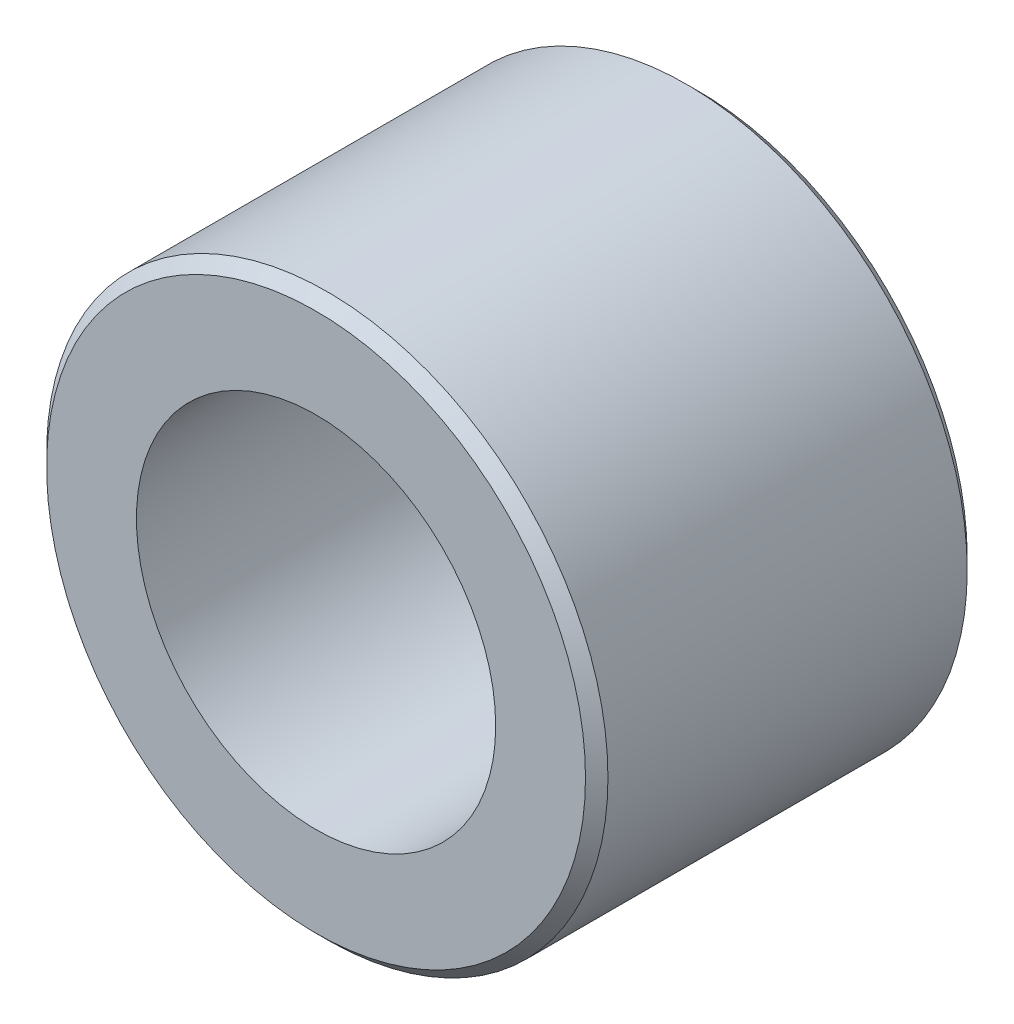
ISO-10303-21;
HEADER;
FILE_DESCRIPTION(('STEP AP214'),'2;1');
FILE_NAME('part.step','',(''),(''),'','','');
FILE_SCHEMA(('AUTOMOTIVE_DESIGN { 1 0 10303 214 1 1 1 1 }'));
ENDSEC;
DATA;
#1=APPLICATION_CONTEXT('core data for automotive mechanical design processes');
#2=APPLICATION_PROTOCOL_DEFINITION('international standard','automotive_design',2000,#1);
#3=PRODUCT_CONTEXT('',#1,'mechanical');
#4=PRODUCT('Part','Part','',(#3));
#5=PRODUCT_RELATED_PRODUCT_CATEGORY('part','',(#4));
#6=PRODUCT_DEFINITION_FORMATION('','',#4);
#7=PRODUCT_DEFINITION_CONTEXT('part definition',#1,'design');
#8=PRODUCT_DEFINITION('design','',#6,#7);
#9=PRODUCT_DEFINITION_SHAPE('','',#8);
#10=(LENGTH_UNIT() NAMED_UNIT(*) SI_UNIT(.MILLI.,.METRE.));
#11=(NAMED_UNIT(*) PLANE_ANGLE_UNIT() SI_UNIT($,.RADIAN.));
#12=(NAMED_UNIT(*) SI_UNIT($,.STERADIAN.) SOLID_ANGLE_UNIT());
#13=UNCERTAINTY_MEASURE_WITH_UNIT(LENGTH_MEASURE(1.E-05),#10,'distance_accuracy_value','');
#14=(GEOMETRIC_REPRESENTATION_CONTEXT(3) GLOBAL_UNCERTAINTY_ASSIGNED_CONTEXT((#13)) GLOBAL_UNIT_ASSIGNED_CONTEXT((#10,
#11,#12)) REPRESENTATION_CONTEXT('',''));
#15=CARTESIAN_POINT('',(0.,0.,0.));
#16=DIRECTION('',(0.,0.,1.));
#17=DIRECTION('',(1.,0.,0.));
#18=AXIS2_PLACEMENT_3D('',#15,#16,#17);
#19=CARTESIAN_POINT('',(0.,0.,17.));
#20=DIRECTION('',(0.,0.,1.));
#21=DIRECTION('',(1.,0.,0.));
#22=AXIS2_PLACEMENT_3D('',#19,#20,#21);
#23=PLANE('',#22);
#24=CARTESIAN_POINT('',(0.,0.,17.));
#25=DIRECTION('',(0.,0.,1.));
#26=DIRECTION('',(1.,0.,0.));
#27=AXIS2_PLACEMENT_3D('',#24,#25,#26);
#28=CIRCLE('',#27,12.);
#29=CARTESIAN_POINT('',(12.,0.,17.));
#30=VERTEX_POINT('',#29);
#31=EDGE_CURVE('E363',#30,#30,#28,.T.);
#32=ORIENTED_EDGE('',*,*,#31,.T.);
#33=EDGE_LOOP('',(#32));
#34=FACE_BOUND('',#33,.T.);
#35=CARTESIAN_POINT('',(0.,0.,17.));
#36=DIRECTION('',(0.,0.,1.));
#37=DIRECTION('',(1.,0.,0.));
#38=AXIS2_PLACEMENT_3D('',#35,#36,#37);
#39=CIRCLE('',#38,8.);
#40=CARTESIAN_POINT('',(8.,0.,17.));
#41=VERTEX_POINT('',#40);
#42=EDGE_CURVE('E368',#41,#41,#39,.T.);
#43=ORIENTED_EDGE('',*,*,#42,.F.);
#44=EDGE_LOOP('',(#43));
#45=FACE_BOUND('',#44,.T.);
#46=ADVANCED_FACE('F348',(#34,#45),#23,.T.);
#47=CARTESIAN_POINT('',(0.,0.,0.));
#48=DIRECTION('',(0.,0.,1.));
#49=DIRECTION('',(1.,0.,0.));
#50=AXIS2_PLACEMENT_3D('',#47,#48,#49);
#51=PLANE('',#50);
#52=CARTESIAN_POINT('',(0.,0.,0.));
#53=DIRECTION('',(0.,0.,1.));
#54=DIRECTION('',(1.,0.,0.));
#55=AXIS2_PLACEMENT_3D('',#52,#53,#54);
#56=CIRCLE('',#55,12.);
#57=CARTESIAN_POINT('',(12.,0.,0.));
#58=VERTEX_POINT('',#57);
#59=EDGE_CURVE('E10',#58,#58,#56,.F.);
#60=ORIENTED_EDGE('',*,*,#59,.T.);
#61=EDGE_LOOP('',(#60));
#62=FACE_BOUND('',#61,.T.);
#63=CARTESIAN_POINT('',(0.,0.,0.));
#64=DIRECTION('',(0.,0.,1.));
#65=DIRECTION('',(1.,0.,0.));
#66=AXIS2_PLACEMENT_3D('',#63,#64,#65);
#67=CIRCLE('',#66,8.);
#68=CARTESIAN_POINT('',(8.,0.,0.));
#69=VERTEX_POINT('',#68);
#70=EDGE_CURVE('E371',#69,#69,#67,.T.);
#71=ORIENTED_EDGE('',*,*,#70,.T.);
#72=EDGE_LOOP('',(#71));
#73=FACE_BOUND('',#72,.T.);
#74=ADVANCED_FACE('F375',(#62,#73),#51,.F.);
#75=CARTESIAN_POINT('',(0.,0.,17.));
#76=DIRECTION('',(0.,0.,-1.));
#77=DIRECTION('',(-1.,0.,0.));
#78=AXIS2_PLACEMENT_3D('',#75,#76,#77);
#79=CYLINDRICAL_SURFACE('',#78,12.5);
#80=CARTESIAN_POINT('',(0.,0.,16.5));
#81=DIRECTION('',(0.,0.,1.));
#82=DIRECTION('',(1.,0.,0.));
#83=AXIS2_PLACEMENT_3D('',#80,#81,#82);
#84=CIRCLE('',#83,12.5);
#85=CARTESIAN_POINT('',(12.5,0.,16.5));
#86=VERTEX_POINT('',#85);
#87=EDGE_CURVE('E355',#86,#86,#84,.F.);
#88=ORIENTED_EDGE('',*,*,#87,.T.);
#89=EDGE_LOOP('',(#88));
#90=FACE_BOUND('',#89,.T.);
#91=CARTESIAN_POINT('',(0.,0.,0.5));
#92=DIRECTION('',(0.,0.,1.));
#93=DIRECTION('',(1.,0.,0.));
#94=AXIS2_PLACEMENT_3D('',#91,#92,#93);
#95=CIRCLE('',#94,12.5);
#96=CARTESIAN_POINT('',(12.5,0.,0.5));
#97=VERTEX_POINT('',#96);
#98=EDGE_CURVE('E359',#97,#97,#95,.T.);
#99=ORIENTED_EDGE('',*,*,#98,.T.);
#100=EDGE_LOOP('',(#99));
#101=FACE_BOUND('',#100,.T.);
#102=ADVANCED_FACE('F350',(#90,#101),#79,.T.);
#103=CARTESIAN_POINT('',(0.,0.,17.));
#104=DIRECTION('',(0.,0.,-1.));
#105=DIRECTION('',(-1.,0.,0.));
#106=AXIS2_PLACEMENT_3D('',#103,#104,#105);
#107=CYLINDRICAL_SURFACE('',#106,8.);
#108=ORIENTED_EDGE('',*,*,#42,.T.);
#109=EDGE_LOOP('',(#108));
#110=FACE_BOUND('',#109,.T.);
#111=ORIENTED_EDGE('',*,*,#70,.F.);
#112=EDGE_LOOP('',(#111));
#113=FACE_BOUND('',#112,.T.);
#114=ADVANCED_FACE('F377',(#110,#113),#107,.F.);
#115=CARTESIAN_POINT('',(0.,0.,17.));
#116=DIRECTION('',(0.,0.,-1.));
#117=DIRECTION('',(-1.,0.,0.));
#118=AXIS2_PLACEMENT_3D('',#115,#116,#117);
#119=CONICAL_SURFACE('',#118,12.,0.785398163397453);
#120=ORIENTED_EDGE('',*,*,#87,.F.);
#121=EDGE_LOOP('',(#120));
#122=FACE_BOUND('',#121,.T.);
#123=ORIENTED_EDGE('',*,*,#31,.F.);
#124=EDGE_LOOP('',(#123));
#125=FACE_BOUND('',#124,.T.);
#126=ADVANCED_FACE('F379',(#122,#125),#119,.T.);
#127=CARTESIAN_POINT('',(0.,0.,0.5));
#128=DIRECTION('',(0.,0.,1.));
#129=DIRECTION('',(1.,0.,0.));
#130=AXIS2_PLACEMENT_3D('',#127,#128,#129);
#131=CONICAL_SURFACE('',#130,12.5,0.785398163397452);
#132=ORIENTED_EDGE('',*,*,#59,.F.);
#133=EDGE_LOOP('',(#132));
#134=FACE_BOUND('',#133,.T.);
#135=ORIENTED_EDGE('',*,*,#98,.F.);
#136=EDGE_LOOP('',(#135));
#137=FACE_BOUND('',#136,.T.);
#138=ADVANCED_FACE('F386',(#134,#137),#131,.T.);
#139=CLOSED_SHELL('',(#46,#74,#102,#114,#126,#138));
#140=MANIFOLD_SOLID_BREP('B2',#139);
#141=ADVANCED_BREP_SHAPE_REPRESENTATION('',(#18,#140),#14);
#142=SHAPE_DEFINITION_REPRESENTATION(#9,#141);
ENDSEC;
END-ISO-10303-21;
